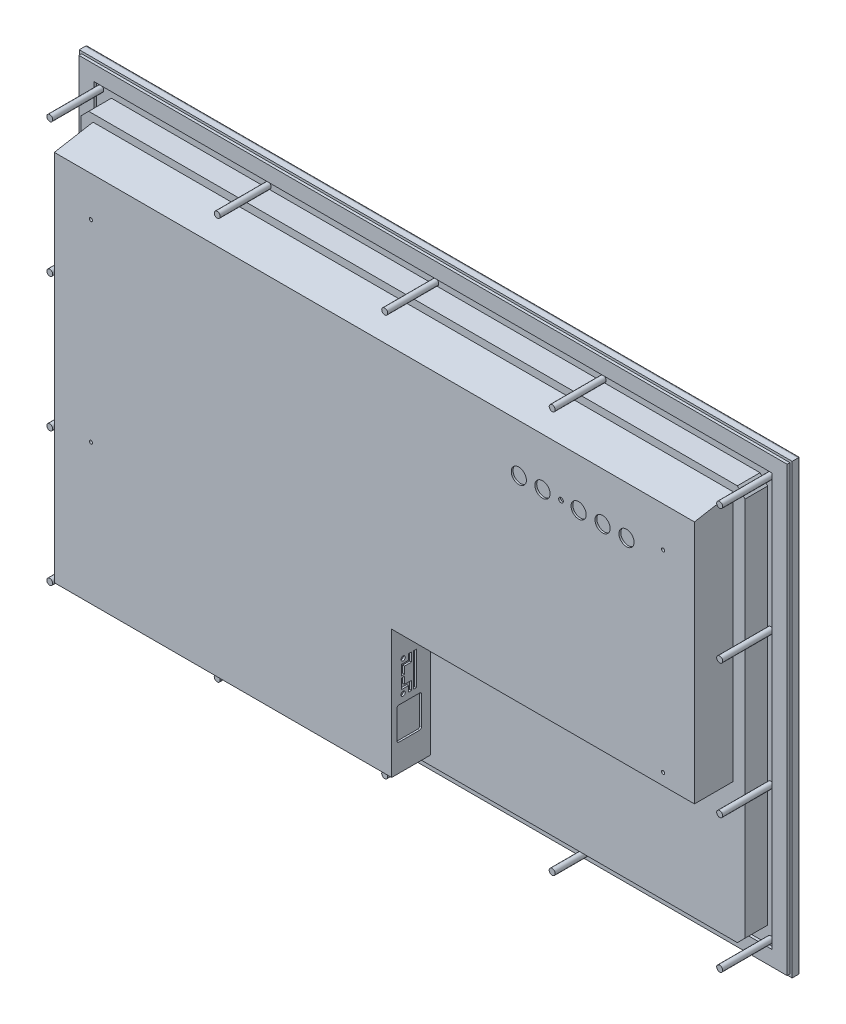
from build123d import *

# Parameters (mm, degrees)
SKETCH1_W                                 = 596.9
SKETCH1_H                                 = 374.65
BEZEL_DEPTH                               = 7.112
BEZEL_RADIUS_R                            = 2
SKETCH2_W                                 = 513.5372
SKETCH2_H                                 = 290.5252
WINDOW_DEPTH                              = 2.35
SKETCH3_W                                 = 593.09
SKETCH3_H                                 = 370.84
SKETCH3_W_2                               = 567.69
SKETCH3_H_2                               = 345.44
GASKET_DEPTH                              = 2.3
SKETCH5_R                                 = 2.5
PANEL_FRAME_STUDS_DEPTH                   = 42.7
BODY_DEPTH                                = 18.9738
REAR_COVER_DEPTH                          = 32.3596
REAR_COVER_SLOPE_ANGLE                    = 10
SKETCH10_R                                = 1.5875
VIDEO_TOUCH_INTERFACE_DEPTH               = 1.524
SKETCH11_R                                = 1.7907
SKETCH11_W                                = 2.54
SKETCH11_H                                = 27.94
POWER_AC_AND_DC_DEPTH                     = 1.524
SKETCH12_R                                = 6.35
SKETCH12_R_2                              = 1.9812
CONTROLS_BUTTONS_DEPTH                    = 1.524
F_6_32_ACCESSORY_BRACKET_HOLES_AT_2_COUNT = 2
F_6_32_ACCESSORY_BRACKET_HOLES_AT_2_PITCH = 161.3408
F_6_32_ACCESSORY_BRACKET_HOLES_AT_3_COUNT = 2
F_6_32_ACCESSORY_BRACKET_HOLES_AT_3_PITCH = 505.483934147
F_6_32_ACCESSORY_BRACKET_HOLES_AT_4_COUNT = 2
F_6_32_ACCESSORY_BRACKET_HOLES_AT_4_PITCH = 479.044


with BuildPart() as part:
    # Sketch1 → Bezel (new body)
    with BuildSketch(Plane.XY):
        Rectangle(SKETCH1_W, SKETCH1_H)
    extrude(amount=-BEZEL_DEPTH)

    # Bezel Radius
    bezel_radius_edges = [part.edges().sort_by_distance(p)[0] for p in [
        (298.45, 0, -7.112),
        (0, 187.325, -7.112),
        (-298.45, 0, -7.112),
        (0, -187.325, -7.112),
    ]]
    fillet(bezel_radius_edges, radius=BEZEL_RADIUS_R)

    # Sketch2 → Window (cut)
    with BuildSketch(Plane(origin=(0, 0, -7.112), x_dir=(-1, 0, 0), z_dir=(0, 0, -1))):
        Rectangle(SKETCH2_W, SKETCH2_H)
    extrude(amount=-WINDOW_DEPTH, mode=Mode.SUBTRACT)

    # Sketch3 → Gasket (add)
    with BuildSketch(Plane.XY):
        Rectangle(SKETCH3_W, SKETCH3_H)
        Rectangle(SKETCH3_W_2, SKETCH3_H_2, mode=Mode.SUBTRACT)
    extrude(amount=GASKET_DEPTH)

    # Sketch5 → Panel Frame Studs (add)
    with BuildSketch(Plane.XY):
        with Locations(Location((-280.4668, 168.1226, 0), (0, 0, 180))):
            Circle(SKETCH5_R)
        with Locations(Location((-140.2334, 168.1226, 0), (0, 0, 180))):
            Circle(SKETCH5_R)
        with Locations(Location((-140.2334, -168.148, 0), (0, 0, 180))):
            Circle(SKETCH5_R)
        with Locations(Location((0, 168.1226, 0), (0, 0, 180))):
            Circle(SKETCH5_R)
        with Locations(Location((0, -168.148, 0), (0, 0, 180))):
            Circle(SKETCH5_R)
        with Locations(Location((140.2334, 168.1226, 0), (0, 0, 180))):
            Circle(SKETCH5_R)
        with Locations(Location((140.2334, -168.148, 0), (0, 0, 180))):
            Circle(SKETCH5_R)
        with Locations(Location((280.4668, 168.1226, 0), (0, 0, 180))):
            Circle(SKETCH5_R)
        with Locations(Location((280.4668, -168.148, 0), (0, 0, 180))):
            Circle(SKETCH5_R)
        with Locations(Location((-280.4668, -168.148, 0), (0, 0, 180))):
            Circle(SKETCH5_R)
        with Locations(Location((-280.4668, 56.0324, 0), (0, 0, 180))):
            Circle(SKETCH5_R)
        with Locations(Location((280.4668, 56.0324, 0), (0, 0, 180))):
            Circle(SKETCH5_R)
        with Locations(Location((-280.4668, -56.0578, 0), (0, 0, 180))):
            Circle(SKETCH5_R)
        with Locations(Location((280.4668, -56.0578, 0), (0, 0, 180))):
            Circle(SKETCH5_R)
    extrude(amount=PANEL_FRAME_STUDS_DEPTH)


with BuildPart() as body_2:
    # Sketch6 → Body (new body)
    with BuildSketch(Plane.XY):
        Polygon((-277.9668, 159.21069713), (-271.55489713, 165.6226), (271.55489713, 165.6226), (277.9668, 159.21069713), (277.9668, -159.23609713), (271.55489713, -165.648), (-271.55489713, -165.648), (-277.9668, -159.23609713), align=None)
    extrude(amount=BODY_DEPTH)


with BuildPart() as body_3:
    # Sketch7 → Rear Cover (new body)
    with BuildSketch(Plane.XY.offset(18.9738)):
        Polygon((-267.97, 159.5374), (267.97, 159.5374), (267.97, -50.673), (14.478, -50.673), (14.478, -158.242), (-267.97, -158.242), align=None)
    extrude(amount=REAR_COVER_DEPTH)

    # Rear Cover Slope
    rear_cover_slope_faces = [body_3.faces().sort_by_distance(p)[0] for p in [
        (0, 159.5374, 35.1536),
    ]]
    draft(rear_cover_slope_faces, Plane.XY.offset(18.9738), REAR_COVER_SLOPE_ANGLE)

    # Sketch10 → Video _ Touch Interface (cut)
    with BuildSketch(Plane(origin=(0, -50.673, 0), x_dir=(1, 0, 0), z_dir=(0, 1, 0))):
        with Locations((131.919305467, -39.78331993)):
            Circle(SKETCH10_R)
        with Locations((99.407305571, -39.78331993)):
            Circle(SKETCH10_R)
        with Locations((165.808305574, -41.05331993)):
            Circle(SKETCH10_R)
        with Locations((140.808311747, -41.05331993)):
            Circle(SKETCH10_R)
        with Locations((191.218134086, -39.60551993)):
            Circle(SKETCH10_R)
        with Locations((216.218127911, -39.60551993)):
            Circle(SKETCH10_R)
        with BuildLine():
            Line((129.32530861, -42.32331993), (129.32530861, -37.24331993))
            ThreePointArc((129.32530861, -37.24331993), (128.43983367, -35.043615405), (126.277308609, -34.070860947))
            Line((126.277308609, -34.070860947), (105.049302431, -34.070860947))
            ThreePointArc((105.049302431, -34.070860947), (102.88677737, -35.043615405), (102.00130243, -37.24331993))
            Line((102.00130243, -37.24331993), (102.00130243, -42.32331993))
            ThreePointArc((102.00130243, -42.32331993), (102.88677737, -44.523024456), (105.049302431, -45.495778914))
            Line((105.049302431, -45.495778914), (126.277308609, -45.495778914))
            ThreePointArc((126.277308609, -45.495778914), (128.43983367, -44.523024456), (129.32530861, -42.32331993))
        make_face()
        with BuildLine():
            Line((163.468269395, -38.50061993), (163.468269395, -43.58061993))
            ThreePointArc((163.468269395, -43.58061993), (162.582794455, -45.780324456), (160.420269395, -46.753078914))
            Line((160.420269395, -46.753078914), (146.196269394, -46.753078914))
            ThreePointArc((146.196269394, -46.753078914), (144.033744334, -45.780324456), (143.148269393, -43.58061993))
            Line((143.148269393, -43.58061993), (143.148269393, -38.50061993))
            ThreePointArc((143.148269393, -38.50061993), (144.033744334, -36.300915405), (146.196269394, -35.328160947))
            Line((146.196269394, -35.328160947), (160.292697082, -35.325619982))
            ThreePointArc((160.292697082, -35.325619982), (162.538131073, -36.255353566), (163.468269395, -38.50061993))
        make_face()
        with BuildLine():
            Line((193.55809173, -37.07821993), (193.55809173, -42.15821993))
            ThreePointArc((193.55809173, -42.15821993), (194.443566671, -44.357924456), (196.606091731, -45.330678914))
            Line((196.606091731, -45.330678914), (210.702519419, -45.333219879))
            ThreePointArc((210.702519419, -45.333219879), (212.94795341, -44.403486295), (213.878091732, -42.15821993))
            Line((213.878091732, -42.15821993), (213.878091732, -37.07821993))
            ThreePointArc((213.878091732, -37.07821993), (212.992616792, -34.878515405), (210.830091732, -33.905760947))
            Line((210.830091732, -33.905760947), (196.606091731, -33.905760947))
            ThreePointArc((196.606091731, -33.905760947), (194.443566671, -34.878515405), (193.55809173, -37.07821993))
        make_face()
        with BuildLine():
            Line((247.325503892, -33.50951993), (231.323503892, -33.50951993))
            Line((231.323503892, -33.50951993), (231.323503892, -38.01801993))
            Line((231.323503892, -38.01801993), (226.878503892, -38.01801993))
            ThreePointArc((226.878503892, -38.01801993), (225.291003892, -39.60551993), (226.878503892, -41.19301993))
            Line((226.878503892, -41.19301993), (231.323503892, -41.19301993))
            Line((231.323503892, -41.19301993), (231.323503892, -45.70151993))
            Line((231.323503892, -45.70151993), (247.325503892, -45.70151993))
            Line((247.325503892, -45.70151993), (247.325503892, -41.19301993))
            Line((247.325503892, -41.19301993), (251.770503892, -41.19301993))
            ThreePointArc((251.770503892, -41.19301993), (253.358003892, -39.60551993), (251.770503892, -38.01801993))
            Line((251.770503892, -38.01801993), (247.325503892, -38.01801993))
            Line((247.325503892, -38.01801993), (247.325503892, -33.50951993))
        make_face()
    extrude(amount=VIDEO_TOUCH_INTERFACE_DEPTH, mode=Mode.SUBTRACT)

    # Sketch11 → Power AC and DC (cut)
    with BuildSketch(Plane.ZY.offset(-14.478)):
        with Locations(Location((41.7576, -102.264596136, 0), (0, 0, 180))):
            Circle(SKETCH11_R)
        with Locations(Location((41.7576, -76.686796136, 0), (0, 0, 180))):
            Circle(SKETCH11_R)
        Polygon((37.2618, -103.445696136), (37.2618, -98.632396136), (43.1546, -98.632396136), (43.1546, -90.237696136), (40.6146, -90.237696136), (40.6146, -96.092396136), (34.7218, -96.092396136), (34.7218, -103.445696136), align=None)
        with Locations((31.9278, -89.475696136)):
            Rectangle(SKETCH11_W, SKETCH11_H)
        Polygon((34.7218, -75.505696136), (37.2618, -75.505696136), (37.2618, -80.318996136), (43.1546, -80.318996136), (43.1546, -88.713696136), (40.6146, -88.713696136), (40.6146, -82.858996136), (34.7218, -82.858996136), align=None)
        with BuildLine():
            Line((26.403543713, -110.17785365), (26.403543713, -134.11735204))
            ThreePointArc((26.403543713, -134.11735204), (26.849912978, -135.194982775), (27.927543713, -135.64135204))
            Line((27.927543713, -135.64135204), (45.377352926, -135.64135204))
            ThreePointArc((45.377352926, -135.64135204), (46.454983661, -135.194982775), (46.901352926, -134.11735204))
            Line((46.901352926, -134.11735204), (46.901352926, -110.17785365))
            ThreePointArc((46.901352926, -110.17785365), (46.454983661, -109.100222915), (45.377352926, -108.65385365))
            Line((45.377352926, -108.65385365), (27.927543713, -108.65385365))
            ThreePointArc((27.927543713, -108.65385365), (26.849912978, -109.100222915), (26.403543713, -110.17785365))
        make_face()
    extrude(amount=POWER_AC_AND_DC_DEPTH, mode=Mode.SUBTRACT)

    # Sketch12 → Controls Buttons (cut)
    with BuildSketch(Plane.XY.offset(51.3334)):
        with Locations((120.9294, 113.7412)):
            Circle(SKETCH12_R)
        with Locations((140.7414, 113.7412)):
            Circle(SKETCH12_R)
        with Locations((170.9674, 113.7412)):
            Circle(SKETCH12_R)
        with Locations((191.0334, 113.7412)):
            Circle(SKETCH12_R)
        with Locations((156.2354, 113.7412)):
            Circle(SKETCH12_R_2)
        with Locations((211.0994, 113.7412)):
            Circle(SKETCH12_R)
    extrude(amount=-CONTROLS_BUTTONS_DEPTH, mode=Mode.SUBTRACT)

    # Sketch14 → 6-32 Accessory Bracket Holes (revolve, cut)
    with BuildSketch(Plane(origin=(-237.3122, -40.9956, 51.3334), x_dir=(0, -1, 0), z_dir=(1, 0, 0))):
        Polygon((0, 0), (0, 16.81469403), (1.35255, 16.002), (1.35255, 0), align=None)
    f_6_32_accessory_bracket_holes = revolve(axis=Axis((-237.3122, -40.9956, 57.6834), (0, 0, -1)), mode=Mode.SUBTRACT)

    # 6-32 Accessory Bracket Holes at 2: 6-32 Accessory Bracket Holes ×2
    with Locations(*[(0, i * F_6_32_ACCESSORY_BRACKET_HOLES_AT_2_PITCH, 0) for i in range(1, F_6_32_ACCESSORY_BRACKET_HOLES_AT_2_COUNT)]):
        add(f_6_32_accessory_bracket_holes, mode=Mode.SUBTRACT)

    # 6-32 Accessory Bracket Holes at 3: 6-32 Accessory Bracket Holes ×2
    with Locations(*[Vector(0.9476938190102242, 0.31918086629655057, 0) * (i * F_6_32_ACCESSORY_BRACKET_HOLES_AT_3_PITCH) for i in range(1, F_6_32_ACCESSORY_BRACKET_HOLES_AT_3_COUNT)]):
        add(f_6_32_accessory_bracket_holes, mode=Mode.SUBTRACT)

    # 6-32 Accessory Bracket Holes at 4: 6-32 Accessory Bracket Holes ×2
    with Locations(*[(i * F_6_32_ACCESSORY_BRACKET_HOLES_AT_4_PITCH, 0, 0) for i in range(1, F_6_32_ACCESSORY_BRACKET_HOLES_AT_4_COUNT)]):
        add(f_6_32_accessory_bracket_holes, mode=Mode.SUBTRACT)


solid = Compound([part.part, body_2.part, body_3.part])
